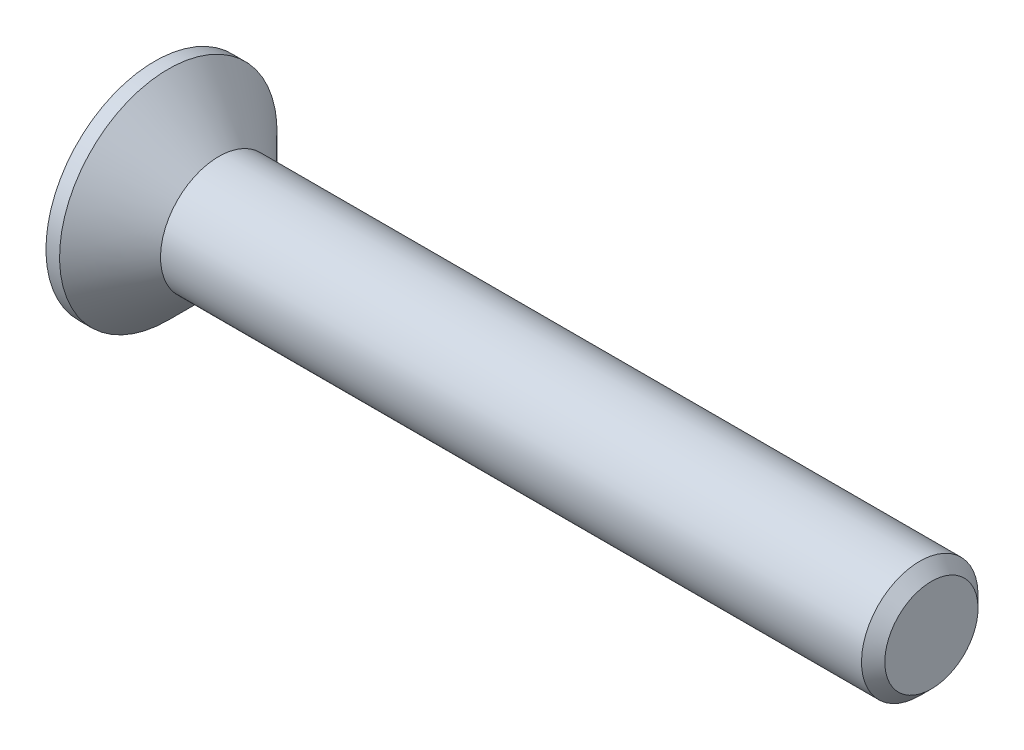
ISO-10303-21;
HEADER;
FILE_DESCRIPTION(('STEP AP214'),'2;1');
FILE_NAME('part.step','',(''),(''),'','','');
FILE_SCHEMA(('AUTOMOTIVE_DESIGN { 1 0 10303 214 1 1 1 1 }'));
ENDSEC;
DATA;
#1=APPLICATION_CONTEXT('core data for automotive mechanical design processes');
#2=APPLICATION_PROTOCOL_DEFINITION('international standard','automotive_design',2000,#1);
#3=PRODUCT_CONTEXT('',#1,'mechanical');
#4=PRODUCT('Part','Part','',(#3));
#5=PRODUCT_RELATED_PRODUCT_CATEGORY('part','',(#4));
#6=PRODUCT_DEFINITION_FORMATION('','',#4);
#7=PRODUCT_DEFINITION_CONTEXT('part definition',#1,'design');
#8=PRODUCT_DEFINITION('design','',#6,#7);
#9=PRODUCT_DEFINITION_SHAPE('','',#8);
#10=(LENGTH_UNIT() NAMED_UNIT(*) SI_UNIT(.MILLI.,.METRE.));
#11=(NAMED_UNIT(*) PLANE_ANGLE_UNIT() SI_UNIT($,.RADIAN.));
#12=(NAMED_UNIT(*) SI_UNIT($,.STERADIAN.) SOLID_ANGLE_UNIT());
#13=UNCERTAINTY_MEASURE_WITH_UNIT(LENGTH_MEASURE(1.E-05),#10,'distance_accuracy_value','');
#14=(GEOMETRIC_REPRESENTATION_CONTEXT(3) GLOBAL_UNCERTAINTY_ASSIGNED_CONTEXT((#13)) GLOBAL_UNIT_ASSIGNED_CONTEXT((#10,
#11,#12)) REPRESENTATION_CONTEXT('',''));
#15=CARTESIAN_POINT('',(0.,0.,0.));
#16=DIRECTION('',(0.,0.,1.));
#17=DIRECTION('',(1.,0.,0.));
#18=AXIS2_PLACEMENT_3D('',#15,#16,#17);
#19=CARTESIAN_POINT('',(0.,0.,0.));
#20=DIRECTION('',(-1.,0.,0.));
#21=DIRECTION('',(0.,-1.,0.));
#22=AXIS2_PLACEMENT_3D('',#19,#20,#21);
#23=CONICAL_SURFACE('',#22,1.5,0.78539816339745);
#24=CARTESIAN_POINT('',(-1.3,0.,0.));
#25=DIRECTION('',(-1.,0.,0.));
#26=DIRECTION('',(0.,-1.,0.));
#27=AXIS2_PLACEMENT_3D('',#24,#25,#26);
#28=CIRCLE('',#27,2.8);
#29=CARTESIAN_POINT('',(-1.3,-2.8,0.));
#30=VERTEX_POINT('',#29);
#31=EDGE_CURVE('E189',#30,#30,#28,.T.);
#32=ORIENTED_EDGE('',*,*,#31,.F.);
#33=EDGE_LOOP('',(#32));
#34=FACE_BOUND('',#33,.T.);
#35=CARTESIAN_POINT('',(0.,0.,0.));
#36=DIRECTION('',(-1.,0.,0.));
#37=DIRECTION('',(0.,-1.,0.));
#38=AXIS2_PLACEMENT_3D('',#35,#36,#37);
#39=CIRCLE('',#38,1.5);
#40=CARTESIAN_POINT('',(0.,-1.5,0.));
#41=VERTEX_POINT('',#40);
#42=EDGE_CURVE('E212',#41,#41,#39,.T.);
#43=ORIENTED_EDGE('',*,*,#42,.T.);
#44=EDGE_LOOP('',(#43));
#45=FACE_BOUND('',#44,.T.);
#46=ADVANCED_FACE('F33',(#34,#45),#23,.T.);
#47=CARTESIAN_POINT('',(-1.65,0.,0.));
#48=DIRECTION('',(-1.,0.,0.));
#49=DIRECTION('',(0.,-1.,0.));
#50=AXIS2_PLACEMENT_3D('',#47,#48,#49);
#51=CYLINDRICAL_SURFACE('',#50,1.5);
#52=CARTESIAN_POINT('',(18.05,0.,0.));
#53=DIRECTION('',(-1.,0.,0.));
#54=DIRECTION('',(0.,-1.,0.));
#55=AXIS2_PLACEMENT_3D('',#52,#53,#54);
#56=CIRCLE('',#55,1.5);
#57=CARTESIAN_POINT('',(18.05,-1.5,0.));
#58=VERTEX_POINT('',#57);
#59=EDGE_CURVE('E41',#58,#58,#56,.T.);
#60=ORIENTED_EDGE('',*,*,#59,.T.);
#61=EDGE_LOOP('',(#60));
#62=FACE_BOUND('',#61,.T.);
#63=ORIENTED_EDGE('',*,*,#42,.F.);
#64=EDGE_LOOP('',(#63));
#65=FACE_BOUND('',#64,.T.);
#66=ADVANCED_FACE('F217',(#62,#65),#51,.T.);
#67=CARTESIAN_POINT('',(18.35,0.,0.));
#68=DIRECTION('',(-1.,0.,0.));
#69=DIRECTION('',(0.,-1.,0.));
#70=AXIS2_PLACEMENT_3D('',#67,#68,#69);
#71=PLANE('',#70);
#72=CARTESIAN_POINT('',(18.35,0.,0.));
#73=DIRECTION('',(-1.,0.,0.));
#74=DIRECTION('',(0.,-1.,0.));
#75=AXIS2_PLACEMENT_3D('',#72,#73,#74);
#76=CIRCLE('',#75,1.2);
#77=CARTESIAN_POINT('',(18.35,-1.2,0.));
#78=VERTEX_POINT('',#77);
#79=EDGE_CURVE('E11',#78,#78,#76,.F.);
#80=ORIENTED_EDGE('',*,*,#79,.T.);
#81=EDGE_LOOP('',(#80));
#82=FACE_BOUND('',#81,.T.);
#83=ADVANCED_FACE('F239',(#82),#71,.F.);
#84=CARTESIAN_POINT('',(-1.65,2.8,0.));
#85=DIRECTION('',(1.,0.,0.));
#86=DIRECTION('',(0.,1.,0.));
#87=AXIS2_PLACEMENT_3D('',#84,#85,#86);
#88=PLANE('',#87);
#89=DIRECTION('',(0.,0.,-1.));
#90=VECTOR('',#89,1.);
#91=CARTESIAN_POINT('',(-1.65,0.365,-1.45));
#92=LINE('',#91,#90);
#93=CARTESIAN_POINT('',(-1.65,0.365,-0.365));
#94=VERTEX_POINT('',#93);
#95=CARTESIAN_POINT('',(-1.65,0.365,-1.45));
#96=VERTEX_POINT('',#95);
#97=EDGE_CURVE('E158',#94,#96,#92,.T.);
#98=ORIENTED_EDGE('',*,*,#97,.F.);
#99=DIRECTION('',(0.,-1.,0.));
#100=VECTOR('',#99,1.);
#101=CARTESIAN_POINT('',(-1.65,0.365,-0.365));
#102=LINE('',#101,#100);
#103=CARTESIAN_POINT('',(-1.65,1.45,-0.365));
#104=VERTEX_POINT('',#103);
#105=EDGE_CURVE('E48',#104,#94,#102,.T.);
#106=ORIENTED_EDGE('',*,*,#105,.F.);
#107=DIRECTION('',(0.,0.,-1.));
#108=VECTOR('',#107,1.);
#109=CARTESIAN_POINT('',(-1.65,1.45,-0.365));
#110=LINE('',#109,#108);
#111=CARTESIAN_POINT('',(-1.65,1.45,0.365));
#112=VERTEX_POINT('',#111);
#113=EDGE_CURVE('E185',#112,#104,#110,.T.);
#114=ORIENTED_EDGE('',*,*,#113,.F.);
#115=DIRECTION('',(0.,1.,0.));
#116=VECTOR('',#115,1.);
#117=CARTESIAN_POINT('',(-1.65,1.45,0.365));
#118=LINE('',#117,#116);
#119=CARTESIAN_POINT('',(-1.65,0.365,0.365));
#120=VERTEX_POINT('',#119);
#121=EDGE_CURVE('E183',#120,#112,#118,.T.);
#122=ORIENTED_EDGE('',*,*,#121,.F.);
#123=DIRECTION('',(0.,0.,-1.));
#124=VECTOR('',#123,1.);
#125=CARTESIAN_POINT('',(-1.65,0.365,0.365));
#126=LINE('',#125,#124);
#127=CARTESIAN_POINT('',(-1.65,0.365,1.45));
#128=VERTEX_POINT('',#127);
#129=EDGE_CURVE('E132',#128,#120,#126,.T.);
#130=ORIENTED_EDGE('',*,*,#129,.F.);
#131=DIRECTION('',(0.,1.,0.));
#132=VECTOR('',#131,1.);
#133=CARTESIAN_POINT('',(-1.65,0.365,1.45));
#134=LINE('',#133,#132);
#135=CARTESIAN_POINT('',(-1.65,-0.365,1.45));
#136=VERTEX_POINT('',#135);
#137=EDGE_CURVE('E179',#136,#128,#134,.T.);
#138=ORIENTED_EDGE('',*,*,#137,.F.);
#139=DIRECTION('',(0.,0.,1.));
#140=VECTOR('',#139,1.);
#141=CARTESIAN_POINT('',(-1.65,-0.365,1.45));
#142=LINE('',#141,#140);
#143=CARTESIAN_POINT('',(-1.65,-0.365,0.365));
#144=VERTEX_POINT('',#143);
#145=EDGE_CURVE('E176',#144,#136,#142,.T.);
#146=ORIENTED_EDGE('',*,*,#145,.F.);
#147=DIRECTION('',(0.,1.,0.));
#148=VECTOR('',#147,1.);
#149=CARTESIAN_POINT('',(-1.65,-0.365,0.365));
#150=LINE('',#149,#148);
#151=CARTESIAN_POINT('',(-1.65,-1.45,0.365));
#152=VERTEX_POINT('',#151);
#153=EDGE_CURVE('E173',#152,#144,#150,.T.);
#154=ORIENTED_EDGE('',*,*,#153,.F.);
#155=DIRECTION('',(0.,0.,1.));
#156=VECTOR('',#155,1.);
#157=CARTESIAN_POINT('',(-1.65,-1.45,0.365));
#158=LINE('',#157,#156);
#159=CARTESIAN_POINT('',(-1.65,-1.45,-0.365));
#160=VERTEX_POINT('',#159);
#161=EDGE_CURVE('E170',#160,#152,#158,.T.);
#162=ORIENTED_EDGE('',*,*,#161,.F.);
#163=DIRECTION('',(0.,-1.,0.));
#164=VECTOR('',#163,1.);
#165=CARTESIAN_POINT('',(-1.65,-1.45,-0.365));
#166=LINE('',#165,#164);
#167=CARTESIAN_POINT('',(-1.65,-0.365,-0.365));
#168=VERTEX_POINT('',#167);
#169=EDGE_CURVE('E167',#168,#160,#166,.T.);
#170=ORIENTED_EDGE('',*,*,#169,.F.);
#171=DIRECTION('',(0.,0.,1.));
#172=VECTOR('',#171,1.);
#173=CARTESIAN_POINT('',(-1.65,-0.365,-0.365));
#174=LINE('',#173,#172);
#175=CARTESIAN_POINT('',(-1.65,-0.365,-1.45));
#176=VERTEX_POINT('',#175);
#177=EDGE_CURVE('E164',#176,#168,#174,.T.);
#178=ORIENTED_EDGE('',*,*,#177,.F.);
#179=DIRECTION('',(0.,-1.,0.));
#180=VECTOR('',#179,1.);
#181=CARTESIAN_POINT('',(-1.65,-0.365,-1.45));
#182=LINE('',#181,#180);
#183=EDGE_CURVE('E161',#96,#176,#182,.T.);
#184=ORIENTED_EDGE('',*,*,#183,.F.);
#185=EDGE_LOOP('',(#98,#106,#114,#122,#130,#138,#146,#154,#162,#170,#178,#184));
#186=FACE_BOUND('',#185,.T.);
#187=CARTESIAN_POINT('',(-1.65,0.,0.));
#188=DIRECTION('',(-1.,0.,0.));
#189=DIRECTION('',(0.,-1.,0.));
#190=AXIS2_PLACEMENT_3D('',#187,#188,#189);
#191=CIRCLE('',#190,2.8);
#192=CARTESIAN_POINT('',(-1.65,-2.8,0.));
#193=VERTEX_POINT('',#192);
#194=EDGE_CURVE('E209',#193,#193,#191,.T.);
#195=ORIENTED_EDGE('',*,*,#194,.T.);
#196=EDGE_LOOP('',(#195));
#197=FACE_BOUND('',#196,.T.);
#198=ADVANCED_FACE('F230',(#186,#197),#88,.F.);
#199=CARTESIAN_POINT('',(-1.65,0.,0.));
#200=DIRECTION('',(-1.,0.,0.));
#201=DIRECTION('',(0.,-1.,0.));
#202=AXIS2_PLACEMENT_3D('',#199,#200,#201);
#203=CYLINDRICAL_SURFACE('',#202,2.8);
#204=ORIENTED_EDGE('',*,*,#194,.F.);
#205=EDGE_LOOP('',(#204));
#206=FACE_BOUND('',#205,.T.);
#207=ORIENTED_EDGE('',*,*,#31,.T.);
#208=EDGE_LOOP('',(#207));
#209=FACE_BOUND('',#208,.T.);
#210=ADVANCED_FACE('F222',(#206,#209),#203,.T.);
#211=CARTESIAN_POINT('',(18.05,0.,0.));
#212=DIRECTION('',(-1.,0.,0.));
#213=DIRECTION('',(0.,-1.,0.));
#214=AXIS2_PLACEMENT_3D('',#211,#212,#213);
#215=CONICAL_SURFACE('',#214,1.5,0.785398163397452);
#216=ORIENTED_EDGE('',*,*,#79,.F.);
#217=EDGE_LOOP('',(#216));
#218=FACE_BOUND('',#217,.T.);
#219=ORIENTED_EDGE('',*,*,#59,.F.);
#220=EDGE_LOOP('',(#219));
#221=FACE_BOUND('',#220,.T.);
#222=ADVANCED_FACE('F35',(#218,#221),#215,.T.);
#223=CARTESIAN_POINT('',(-0.4,0.365,-0.365));
#224=DIRECTION('',(0.,0.,-1.));
#225=DIRECTION('',(-1.,0.,0.));
#226=AXIS2_PLACEMENT_3D('',#223,#224,#225);
#227=PLANE('',#226);
#228=ORIENTED_EDGE('',*,*,#105,.T.);
#229=DIRECTION('',(-1.,0.,0.));
#230=VECTOR('',#229,1.);
#231=CARTESIAN_POINT('',(-0.4,0.365,-0.365));
#232=LINE('',#231,#230);
#233=CARTESIAN_POINT('',(-0.4,0.365,-0.365));
#234=VERTEX_POINT('',#233);
#235=EDGE_CURVE('E96',#234,#94,#232,.T.);
#236=ORIENTED_EDGE('',*,*,#235,.F.);
#237=DIRECTION('',(0.,-1.,0.));
#238=VECTOR('',#237,1.);
#239=CARTESIAN_POINT('',(-0.4,0.365,-0.365));
#240=LINE('',#239,#238);
#241=CARTESIAN_POINT('',(-0.4,1.45,-0.365));
#242=VERTEX_POINT('',#241);
#243=EDGE_CURVE('E187',#242,#234,#240,.T.);
#244=ORIENTED_EDGE('',*,*,#243,.F.);
#245=DIRECTION('',(-1.,0.,0.));
#246=VECTOR('',#245,1.);
#247=CARTESIAN_POINT('',(-0.4,1.45,-0.365));
#248=LINE('',#247,#246);
#249=EDGE_CURVE('E56',#242,#104,#248,.T.);
#250=ORIENTED_EDGE('',*,*,#249,.T.);
#251=EDGE_LOOP('',(#228,#236,#244,#250));
#252=FACE_BOUND('',#251,.T.);
#253=ADVANCED_FACE('F221',(#252),#227,.F.);
#254=CARTESIAN_POINT('',(-0.4,1.45,-0.365));
#255=DIRECTION('',(0.,1.,0.));
#256=DIRECTION('',(-1.,0.,0.));
#257=AXIS2_PLACEMENT_3D('',#254,#255,#256);
#258=PLANE('',#257);
#259=ORIENTED_EDGE('',*,*,#113,.T.);
#260=ORIENTED_EDGE('',*,*,#249,.F.);
#261=DIRECTION('',(0.,0.,-1.));
#262=VECTOR('',#261,1.);
#263=CARTESIAN_POINT('',(-0.4,1.45,-0.365));
#264=LINE('',#263,#262);
#265=CARTESIAN_POINT('',(-0.4,1.45,0.365));
#266=VERTEX_POINT('',#265);
#267=EDGE_CURVE('E144',#266,#242,#264,.T.);
#268=ORIENTED_EDGE('',*,*,#267,.F.);
#269=DIRECTION('',(-1.,0.,0.));
#270=VECTOR('',#269,1.);
#271=CARTESIAN_POINT('',(-0.4,1.45,0.365));
#272=LINE('',#271,#270);
#273=EDGE_CURVE('E136',#266,#112,#272,.T.);
#274=ORIENTED_EDGE('',*,*,#273,.T.);
#275=EDGE_LOOP('',(#259,#260,#268,#274));
#276=FACE_BOUND('',#275,.T.);
#277=ADVANCED_FACE('F228',(#276),#258,.F.);
#278=CARTESIAN_POINT('',(-0.4,1.45,0.365));
#279=DIRECTION('',(0.,0.,1.));
#280=DIRECTION('',(1.,0.,0.));
#281=AXIS2_PLACEMENT_3D('',#278,#279,#280);
#282=PLANE('',#281);
#283=ORIENTED_EDGE('',*,*,#121,.T.);
#284=ORIENTED_EDGE('',*,*,#273,.F.);
#285=DIRECTION('',(0.,1.,0.));
#286=VECTOR('',#285,1.);
#287=CARTESIAN_POINT('',(-0.4,1.45,0.365));
#288=LINE('',#287,#286);
#289=CARTESIAN_POINT('',(-0.4,0.365,0.365));
#290=VERTEX_POINT('',#289);
#291=EDGE_CURVE('E140',#290,#266,#288,.T.);
#292=ORIENTED_EDGE('',*,*,#291,.F.);
#293=DIRECTION('',(-1.,0.,0.));
#294=VECTOR('',#293,1.);
#295=CARTESIAN_POINT('',(-0.4,0.365,0.365));
#296=LINE('',#295,#294);
#297=EDGE_CURVE('E125',#290,#120,#296,.T.);
#298=ORIENTED_EDGE('',*,*,#297,.T.);
#299=EDGE_LOOP('',(#283,#284,#292,#298));
#300=FACE_BOUND('',#299,.T.);
#301=ADVANCED_FACE('F141',(#300),#282,.F.);
#302=CARTESIAN_POINT('',(-0.4,0.365,0.365));
#303=DIRECTION('',(0.,1.,0.));
#304=DIRECTION('',(-1.,0.,0.));
#305=AXIS2_PLACEMENT_3D('',#302,#303,#304);
#306=PLANE('',#305);
#307=ORIENTED_EDGE('',*,*,#129,.T.);
#308=ORIENTED_EDGE('',*,*,#297,.F.);
#309=DIRECTION('',(0.,0.,-1.));
#310=VECTOR('',#309,1.);
#311=CARTESIAN_POINT('',(-0.4,0.365,0.365));
#312=LINE('',#311,#310);
#313=CARTESIAN_POINT('',(-0.4,0.365,1.45));
#314=VERTEX_POINT('',#313);
#315=EDGE_CURVE('E129',#314,#290,#312,.T.);
#316=ORIENTED_EDGE('',*,*,#315,.F.);
#317=DIRECTION('',(-1.,0.,0.));
#318=VECTOR('',#317,1.);
#319=CARTESIAN_POINT('',(-0.4,0.365,1.45));
#320=LINE('',#319,#318);
#321=EDGE_CURVE('E137',#314,#128,#320,.T.);
#322=ORIENTED_EDGE('',*,*,#321,.T.);
#323=EDGE_LOOP('',(#307,#308,#316,#322));
#324=FACE_BOUND('',#323,.T.);
#325=ADVANCED_FACE('F127',(#324),#306,.F.);
#326=CARTESIAN_POINT('',(-0.4,0.365,1.45));
#327=DIRECTION('',(0.,0.,1.));
#328=DIRECTION('',(1.,0.,0.));
#329=AXIS2_PLACEMENT_3D('',#326,#327,#328);
#330=PLANE('',#329);
#331=ORIENTED_EDGE('',*,*,#137,.T.);
#332=ORIENTED_EDGE('',*,*,#321,.F.);
#333=DIRECTION('',(0.,1.,0.));
#334=VECTOR('',#333,1.);
#335=CARTESIAN_POINT('',(-0.4,0.365,1.45));
#336=LINE('',#335,#334);
#337=CARTESIAN_POINT('',(-0.4,-0.365,1.45));
#338=VERTEX_POINT('',#337);
#339=EDGE_CURVE('E150',#338,#314,#336,.T.);
#340=ORIENTED_EDGE('',*,*,#339,.F.);
#341=DIRECTION('',(-1.,0.,0.));
#342=VECTOR('',#341,1.);
#343=CARTESIAN_POINT('',(-0.4,-0.365,1.45));
#344=LINE('',#343,#342);
#345=EDGE_CURVE('E192',#338,#136,#344,.T.);
#346=ORIENTED_EDGE('',*,*,#345,.T.);
#347=EDGE_LOOP('',(#331,#332,#340,#346));
#348=FACE_BOUND('',#347,.T.);
#349=ADVANCED_FACE('F277',(#348),#330,.F.);
#350=CARTESIAN_POINT('',(-0.4,-0.365,1.45));
#351=DIRECTION('',(0.,-1.,0.));
#352=DIRECTION('',(1.,0.,0.));
#353=AXIS2_PLACEMENT_3D('',#350,#351,#352);
#354=PLANE('',#353);
#355=ORIENTED_EDGE('',*,*,#145,.T.);
#356=ORIENTED_EDGE('',*,*,#345,.F.);
#357=DIRECTION('',(0.,0.,1.));
#358=VECTOR('',#357,1.);
#359=CARTESIAN_POINT('',(-0.4,-0.365,1.45));
#360=LINE('',#359,#358);
#361=CARTESIAN_POINT('',(-0.4,-0.365,0.365));
#362=VERTEX_POINT('',#361);
#363=EDGE_CURVE('E152',#362,#338,#360,.T.);
#364=ORIENTED_EDGE('',*,*,#363,.F.);
#365=DIRECTION('',(-1.,0.,0.));
#366=VECTOR('',#365,1.);
#367=CARTESIAN_POINT('',(-0.4,-0.365,0.365));
#368=LINE('',#367,#366);
#369=EDGE_CURVE('E194',#362,#144,#368,.T.);
#370=ORIENTED_EDGE('',*,*,#369,.T.);
#371=EDGE_LOOP('',(#355,#356,#364,#370));
#372=FACE_BOUND('',#371,.T.);
#373=ADVANCED_FACE('F273',(#372),#354,.F.);
#374=CARTESIAN_POINT('',(-0.4,-0.365,0.365));
#375=DIRECTION('',(0.,0.,1.));
#376=DIRECTION('',(1.,0.,0.));
#377=AXIS2_PLACEMENT_3D('',#374,#375,#376);
#378=PLANE('',#377);
#379=ORIENTED_EDGE('',*,*,#153,.T.);
#380=ORIENTED_EDGE('',*,*,#369,.F.);
#381=DIRECTION('',(0.,1.,0.));
#382=VECTOR('',#381,1.);
#383=CARTESIAN_POINT('',(-0.4,-0.365,0.365));
#384=LINE('',#383,#382);
#385=CARTESIAN_POINT('',(-0.4,-1.45,0.365));
#386=VERTEX_POINT('',#385);
#387=EDGE_CURVE('E422',#386,#362,#384,.T.);
#388=ORIENTED_EDGE('',*,*,#387,.F.);
#389=DIRECTION('',(-1.,0.,0.));
#390=VECTOR('',#389,1.);
#391=CARTESIAN_POINT('',(-0.4,-1.45,0.365));
#392=LINE('',#391,#390);
#393=EDGE_CURVE('E196',#386,#152,#392,.T.);
#394=ORIENTED_EDGE('',*,*,#393,.T.);
#395=EDGE_LOOP('',(#379,#380,#388,#394));
#396=FACE_BOUND('',#395,.T.);
#397=ADVANCED_FACE('F269',(#396),#378,.F.);
#398=CARTESIAN_POINT('',(-0.4,-1.45,0.365));
#399=DIRECTION('',(0.,-1.,0.));
#400=DIRECTION('',(1.,0.,0.));
#401=AXIS2_PLACEMENT_3D('',#398,#399,#400);
#402=PLANE('',#401);
#403=ORIENTED_EDGE('',*,*,#161,.T.);
#404=ORIENTED_EDGE('',*,*,#393,.F.);
#405=DIRECTION('',(0.,0.,1.));
#406=VECTOR('',#405,1.);
#407=CARTESIAN_POINT('',(-0.4,-1.45,0.365));
#408=LINE('',#407,#406);
#409=CARTESIAN_POINT('',(-0.4,-1.45,-0.365));
#410=VERTEX_POINT('',#409);
#411=EDGE_CURVE('E419',#410,#386,#408,.T.);
#412=ORIENTED_EDGE('',*,*,#411,.F.);
#413=DIRECTION('',(-1.,0.,0.));
#414=VECTOR('',#413,1.);
#415=CARTESIAN_POINT('',(-0.4,-1.45,-0.365));
#416=LINE('',#415,#414);
#417=EDGE_CURVE('E198',#410,#160,#416,.T.);
#418=ORIENTED_EDGE('',*,*,#417,.T.);
#419=EDGE_LOOP('',(#403,#404,#412,#418));
#420=FACE_BOUND('',#419,.T.);
#421=ADVANCED_FACE('F265',(#420),#402,.F.);
#422=CARTESIAN_POINT('',(-0.4,-1.45,-0.365));
#423=DIRECTION('',(0.,0.,-1.));
#424=DIRECTION('',(-1.,0.,0.));
#425=AXIS2_PLACEMENT_3D('',#422,#423,#424);
#426=PLANE('',#425);
#427=ORIENTED_EDGE('',*,*,#169,.T.);
#428=ORIENTED_EDGE('',*,*,#417,.F.);
#429=DIRECTION('',(0.,-1.,0.));
#430=VECTOR('',#429,1.);
#431=CARTESIAN_POINT('',(-0.4,-1.45,-0.365));
#432=LINE('',#431,#430);
#433=CARTESIAN_POINT('',(-0.4,-0.365,-0.365));
#434=VERTEX_POINT('',#433);
#435=EDGE_CURVE('E416',#434,#410,#432,.T.);
#436=ORIENTED_EDGE('',*,*,#435,.F.);
#437=DIRECTION('',(-1.,0.,0.));
#438=VECTOR('',#437,1.);
#439=CARTESIAN_POINT('',(-0.4,-0.365,-0.365));
#440=LINE('',#439,#438);
#441=EDGE_CURVE('E200',#434,#168,#440,.T.);
#442=ORIENTED_EDGE('',*,*,#441,.T.);
#443=EDGE_LOOP('',(#427,#428,#436,#442));
#444=FACE_BOUND('',#443,.T.);
#445=ADVANCED_FACE('F261',(#444),#426,.F.);
#446=CARTESIAN_POINT('',(-0.4,-0.365,-0.365));
#447=DIRECTION('',(0.,-1.,0.));
#448=DIRECTION('',(1.,0.,0.));
#449=AXIS2_PLACEMENT_3D('',#446,#447,#448);
#450=PLANE('',#449);
#451=ORIENTED_EDGE('',*,*,#177,.T.);
#452=ORIENTED_EDGE('',*,*,#441,.F.);
#453=DIRECTION('',(0.,0.,1.));
#454=VECTOR('',#453,1.);
#455=CARTESIAN_POINT('',(-0.4,-0.365,-0.365));
#456=LINE('',#455,#454);
#457=CARTESIAN_POINT('',(-0.4,-0.365,-1.45));
#458=VERTEX_POINT('',#457);
#459=EDGE_CURVE('E413',#458,#434,#456,.T.);
#460=ORIENTED_EDGE('',*,*,#459,.F.);
#461=DIRECTION('',(-1.,0.,0.));
#462=VECTOR('',#461,1.);
#463=CARTESIAN_POINT('',(-0.4,-0.365,-1.45));
#464=LINE('',#463,#462);
#465=EDGE_CURVE('E202',#458,#176,#464,.T.);
#466=ORIENTED_EDGE('',*,*,#465,.T.);
#467=EDGE_LOOP('',(#451,#452,#460,#466));
#468=FACE_BOUND('',#467,.T.);
#469=ADVANCED_FACE('F257',(#468),#450,.F.);
#470=CARTESIAN_POINT('',(-0.4,-0.365,-1.45));
#471=DIRECTION('',(0.,0.,-1.));
#472=DIRECTION('',(-1.,0.,0.));
#473=AXIS2_PLACEMENT_3D('',#470,#471,#472);
#474=PLANE('',#473);
#475=ORIENTED_EDGE('',*,*,#183,.T.);
#476=ORIENTED_EDGE('',*,*,#465,.F.);
#477=DIRECTION('',(0.,-1.,0.));
#478=VECTOR('',#477,1.);
#479=CARTESIAN_POINT('',(-0.4,-0.365,-1.45));
#480=LINE('',#479,#478);
#481=CARTESIAN_POINT('',(-0.4,0.365,-1.45));
#482=VERTEX_POINT('',#481);
#483=EDGE_CURVE('E408',#482,#458,#480,.T.);
#484=ORIENTED_EDGE('',*,*,#483,.F.);
#485=DIRECTION('',(-1.,0.,0.));
#486=VECTOR('',#485,1.);
#487=CARTESIAN_POINT('',(-0.4,0.365,-1.45));
#488=LINE('',#487,#486);
#489=EDGE_CURVE('E204',#482,#96,#488,.T.);
#490=ORIENTED_EDGE('',*,*,#489,.T.);
#491=EDGE_LOOP('',(#475,#476,#484,#490));
#492=FACE_BOUND('',#491,.T.);
#493=ADVANCED_FACE('F253',(#492),#474,.F.);
#494=CARTESIAN_POINT('',(-0.4,0.365,-1.45));
#495=DIRECTION('',(0.,1.,0.));
#496=DIRECTION('',(-1.,0.,0.));
#497=AXIS2_PLACEMENT_3D('',#494,#495,#496);
#498=PLANE('',#497);
#499=ORIENTED_EDGE('',*,*,#97,.T.);
#500=ORIENTED_EDGE('',*,*,#489,.F.);
#501=DIRECTION('',(0.,0.,-1.));
#502=VECTOR('',#501,1.);
#503=CARTESIAN_POINT('',(-0.4,0.365,-1.45));
#504=LINE('',#503,#502);
#505=EDGE_CURVE('E406',#234,#482,#504,.T.);
#506=ORIENTED_EDGE('',*,*,#505,.F.);
#507=ORIENTED_EDGE('',*,*,#235,.T.);
#508=EDGE_LOOP('',(#499,#500,#506,#507));
#509=FACE_BOUND('',#508,.T.);
#510=ADVANCED_FACE('F250',(#509),#498,.F.);
#511=CARTESIAN_POINT('',(-0.4,0.,0.));
#512=DIRECTION('',(1.,0.,0.));
#513=DIRECTION('',(0.,0.,-1.));
#514=AXIS2_PLACEMENT_3D('',#511,#512,#513);
#515=PLANE('',#514);
#516=ORIENTED_EDGE('',*,*,#243,.T.);
#517=ORIENTED_EDGE('',*,*,#505,.T.);
#518=ORIENTED_EDGE('',*,*,#483,.T.);
#519=ORIENTED_EDGE('',*,*,#459,.T.);
#520=ORIENTED_EDGE('',*,*,#435,.T.);
#521=ORIENTED_EDGE('',*,*,#411,.T.);
#522=ORIENTED_EDGE('',*,*,#387,.T.);
#523=ORIENTED_EDGE('',*,*,#363,.T.);
#524=ORIENTED_EDGE('',*,*,#339,.T.);
#525=ORIENTED_EDGE('',*,*,#315,.T.);
#526=ORIENTED_EDGE('',*,*,#291,.T.);
#527=ORIENTED_EDGE('',*,*,#267,.T.);
#528=EDGE_LOOP('',(#516,#517,#518,#519,#520,#521,#522,#523,#524,#525,#526,#527));
#529=FACE_BOUND('',#528,.T.);
#530=ADVANCED_FACE('F147',(#529),#515,.F.);
#531=CLOSED_SHELL('',(#46,#66,#83,#198,#210,#222,#253,#277,#301,#325,#349,#373,#397,#421,#445,
#469,#493,#510,#530));
#532=MANIFOLD_SOLID_BREP('B2',#531);
#533=ADVANCED_BREP_SHAPE_REPRESENTATION('',(#18,#532),#14);
#534=SHAPE_DEFINITION_REPRESENTATION(#9,#533);
ENDSEC;
END-ISO-10303-21;
